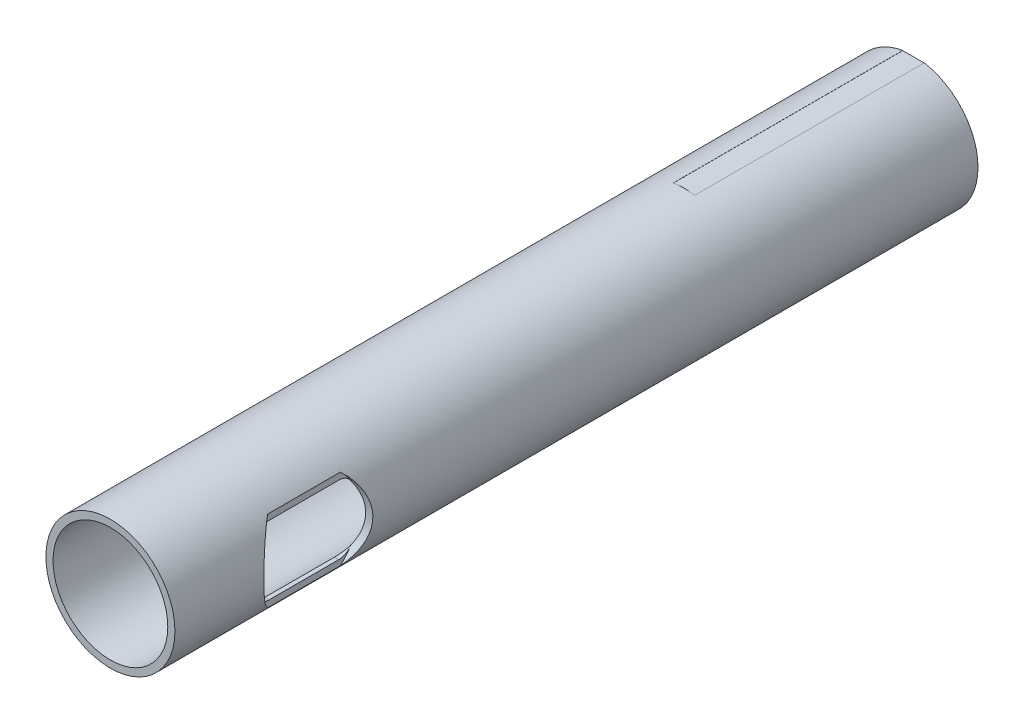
ISO-10303-21;
HEADER;
FILE_DESCRIPTION(('STEP AP214'),'2;1');
FILE_NAME('part.step','',(''),(''),'','','');
FILE_SCHEMA(('AUTOMOTIVE_DESIGN { 1 0 10303 214 1 1 1 1 }'));
ENDSEC;
DATA;
#1=APPLICATION_CONTEXT('core data for automotive mechanical design processes');
#2=APPLICATION_PROTOCOL_DEFINITION('international standard','automotive_design',2000,#1);
#3=PRODUCT_CONTEXT('',#1,'mechanical');
#4=PRODUCT('Part','Part','',(#3));
#5=PRODUCT_RELATED_PRODUCT_CATEGORY('part','',(#4));
#6=PRODUCT_DEFINITION_FORMATION('','',#4);
#7=PRODUCT_DEFINITION_CONTEXT('part definition',#1,'design');
#8=PRODUCT_DEFINITION('design','',#6,#7);
#9=PRODUCT_DEFINITION_SHAPE('','',#8);
#10=(LENGTH_UNIT() NAMED_UNIT(*) SI_UNIT(.MILLI.,.METRE.));
#11=(NAMED_UNIT(*) PLANE_ANGLE_UNIT() SI_UNIT($,.RADIAN.));
#12=(NAMED_UNIT(*) SI_UNIT($,.STERADIAN.) SOLID_ANGLE_UNIT());
#13=UNCERTAINTY_MEASURE_WITH_UNIT(LENGTH_MEASURE(1.E-05),#10,'distance_accuracy_value','');
#14=(GEOMETRIC_REPRESENTATION_CONTEXT(3) GLOBAL_UNCERTAINTY_ASSIGNED_CONTEXT((#13)) GLOBAL_UNIT_ASSIGNED_CONTEXT((#10,
#11,#12)) REPRESENTATION_CONTEXT('',''));
#15=CARTESIAN_POINT('',(0.,0.,0.));
#16=DIRECTION('',(0.,0.,1.));
#17=DIRECTION('',(1.,0.,0.));
#18=AXIS2_PLACEMENT_3D('',#15,#16,#17);
#19=CARTESIAN_POINT('',(0.,0.,-355.6));
#20=DIRECTION('',(0.,0.,1.));
#21=DIRECTION('',(1.,0.,0.));
#22=AXIS2_PLACEMENT_3D('',#19,#20,#21);
#23=CYLINDRICAL_SURFACE('',#22,28.575);
#24=DIRECTION('',(0.,0.,1.));
#25=VECTOR('',#24,1.);
#26=CARTESIAN_POINT('',(-4.74980000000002,28.1774737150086,-355.6));
#27=LINE('',#26,#25);
#28=CARTESIAN_POINT('',(-4.74980000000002,28.1774737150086,-355.6));
#29=VERTEX_POINT('',#28);
#30=CARTESIAN_POINT('',(-4.74980000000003,28.1774737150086,-254.));
#31=VERTEX_POINT('',#30);
#32=EDGE_CURVE('E347',#29,#31,#27,.T.);
#33=ORIENTED_EDGE('',*,*,#32,.F.);
#34=CARTESIAN_POINT('',(0.,0.,-355.6));
#35=DIRECTION('',(0.,0.,1.));
#36=DIRECTION('',(1.,0.,0.));
#37=AXIS2_PLACEMENT_3D('',#34,#35,#36);
#38=CIRCLE('',#37,28.575);
#39=CARTESIAN_POINT('',(-4.74980000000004,-28.1774737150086,-355.6));
#40=VERTEX_POINT('',#39);
#41=EDGE_CURVE('E207',#29,#40,#38,.T.);
#42=ORIENTED_EDGE('',*,*,#41,.T.);
#43=DIRECTION('',(0.,0.,1.));
#44=VECTOR('',#43,1.);
#45=CARTESIAN_POINT('',(-4.74980000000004,-28.1774737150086,-355.6));
#46=LINE('',#45,#44);
#47=CARTESIAN_POINT('',(-4.74980000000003,-28.1774737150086,-254.));
#48=VERTEX_POINT('',#47);
#49=EDGE_CURVE('E375',#48,#40,#46,.F.);
#50=ORIENTED_EDGE('',*,*,#49,.F.);
#51=CARTESIAN_POINT('',(0.,0.,-254.));
#52=DIRECTION('',(0.,0.,1.));
#53=DIRECTION('',(1.,0.,0.));
#54=AXIS2_PLACEMENT_3D('',#51,#52,#53);
#55=CIRCLE('',#54,28.575);
#56=CARTESIAN_POINT('',(4.74979999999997,-28.1774737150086,-254.));
#57=VERTEX_POINT('',#56);
#58=EDGE_CURVE('E217',#57,#48,#55,.F.);
#59=ORIENTED_EDGE('',*,*,#58,.F.);
#60=DIRECTION('',(0.,0.,1.));
#61=VECTOR('',#60,1.);
#62=CARTESIAN_POINT('',(4.74979999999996,-28.1774737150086,-355.6));
#63=LINE('',#62,#61);
#64=CARTESIAN_POINT('',(4.74979999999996,-28.1774737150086,-355.6));
#65=VERTEX_POINT('',#64);
#66=EDGE_CURVE('E369',#65,#57,#63,.T.);
#67=ORIENTED_EDGE('',*,*,#66,.F.);
#68=CARTESIAN_POINT('',(4.74979999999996,28.1774737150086,-355.6));
#69=VERTEX_POINT('',#68);
#70=EDGE_CURVE('E455',#65,#69,#38,.T.);
#71=ORIENTED_EDGE('',*,*,#70,.T.);
#72=DIRECTION('',(0.,0.,1.));
#73=VECTOR('',#72,1.);
#74=CARTESIAN_POINT('',(4.74979999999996,28.1774737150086,-355.6));
#75=LINE('',#74,#73);
#76=CARTESIAN_POINT('',(4.74979999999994,28.1774737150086,-254.));
#77=VERTEX_POINT('',#76);
#78=EDGE_CURVE('E342',#77,#69,#75,.F.);
#79=ORIENTED_EDGE('',*,*,#78,.F.);
#80=CARTESIAN_POINT('',(0.,0.,-254.));
#81=DIRECTION('',(0.,0.,1.));
#82=DIRECTION('',(1.,0.,0.));
#83=AXIS2_PLACEMENT_3D('',#80,#81,#82);
#84=CIRCLE('',#83,28.575);
#85=EDGE_CURVE('E209',#31,#77,#84,.F.);
#86=ORIENTED_EDGE('',*,*,#85,.F.);
#87=EDGE_LOOP('',(#33,#42,#50,#59,#67,#71,#79,#86));
#88=FACE_BOUND('',#87,.T.);
#89=CARTESIAN_POINT('',(0.,0.,0.));
#90=DIRECTION('',(0.,0.,1.));
#91=DIRECTION('',(1.,0.,0.));
#92=AXIS2_PLACEMENT_3D('',#89,#90,#91);
#93=CIRCLE('',#92,28.575);
#94=CARTESIAN_POINT('',(28.575,0.,0.));
#95=VERTEX_POINT('',#94);
#96=EDGE_CURVE('E456',#95,#95,#93,.T.);
#97=ORIENTED_EDGE('',*,*,#96,.F.);
#98=EDGE_LOOP('',(#97));
#99=FACE_BOUND('',#98,.T.);
#100=CARTESIAN_POINT('',(22.225,-17.9605122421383,-47.3855065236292));
#101=CARTESIAN_POINT('',(22.3970312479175,-17.7476348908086,-47.1482542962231));
#102=CARTESIAN_POINT('',(22.5680680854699,-17.5297298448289,-46.9148333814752));
#103=CARTESIAN_POINT('',(22.9074990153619,-17.0837833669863,-46.4558296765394));
#104=CARTESIAN_POINT('',(23.0758928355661,-16.8557409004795,-46.2302476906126));
#105=CARTESIAN_POINT('',(23.5764540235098,-16.1558242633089,-45.565092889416));
#106=CARTESIAN_POINT('',(23.9036080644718,-15.6686431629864,-45.137650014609));
#107=CARTESIAN_POINT('',(24.5413552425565,-14.6498009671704,-44.3147858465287));
#108=CARTESIAN_POINT('',(24.8517964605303,-14.11781775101,-43.9196453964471));
#109=CARTESIAN_POINT('',(25.4474190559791,-13.0135555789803,-43.169000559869));
#110=CARTESIAN_POINT('',(25.732613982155,-12.4412985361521,-42.8134748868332));
#111=CARTESIAN_POINT('',(26.221628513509,-11.3682341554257,-42.2085573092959));
#112=CARTESIAN_POINT('',(26.4307057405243,-10.8740010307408,-41.9517365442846));
#113=CARTESIAN_POINT('',(26.8250744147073,-9.86109916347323,-41.4697914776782));
#114=CARTESIAN_POINT('',(27.0103664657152,-9.34243104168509,-41.2446663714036));
#115=CARTESIAN_POINT('',(27.353427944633,-8.28426349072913,-40.8295365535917));
#116=CARTESIAN_POINT('',(27.5112759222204,-7.74482909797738,-40.6394315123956));
#117=CARTESIAN_POINT('',(27.7970553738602,-6.64652209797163,-40.296302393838));
#118=CARTESIAN_POINT('',(27.9249871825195,-6.08764970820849,-40.1432779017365));
#119=CARTESIAN_POINT('',(28.1491183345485,-4.949433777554,-39.875764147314));
#120=CARTESIAN_POINT('',(28.2450483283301,-4.36995977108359,-39.7616018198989));
#121=CARTESIAN_POINT('',(28.4014532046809,-3.19947640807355,-39.5757163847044));
#122=CARTESIAN_POINT('',(28.4619277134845,-2.60846692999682,-39.5039937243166));
#123=CARTESIAN_POINT('',(28.5459138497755,-1.41999435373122,-39.4044363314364));
#124=CARTESIAN_POINT('',(28.569416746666,-0.822529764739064,-39.3766119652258));
#125=CARTESIAN_POINT('',(28.5788158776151,0.373076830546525,-39.3654809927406));
#126=CARTESIAN_POINT('',(28.5647158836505,0.97121876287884,-39.3821699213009));
#127=CARTESIAN_POINT('',(28.5031634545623,2.09220282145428,-39.4551062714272));
#128=CARTESIAN_POINT('',(28.4598420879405,2.6156033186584,-39.5064544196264));
#129=CARTESIAN_POINT('',(28.3451206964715,3.65485942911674,-39.6426427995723));
#130=CARTESIAN_POINT('',(28.2737233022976,4.17071574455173,-39.727479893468));
#131=CARTESIAN_POINT('',(28.1042310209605,5.19137624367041,-39.9293174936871));
#132=CARTESIAN_POINT('',(28.0061467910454,5.6961847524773,-40.0463051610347));
#133=CARTESIAN_POINT('',(27.7850022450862,6.69212381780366,-40.310823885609));
#134=CARTESIAN_POINT('',(27.6619407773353,7.18325374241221,-40.4583563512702));
#135=CARTESIAN_POINT('',(27.3889754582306,8.16338534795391,-40.7867697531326));
#136=CARTESIAN_POINT('',(27.238400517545,8.65191821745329,-40.9684888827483));
#137=CARTESIAN_POINT('',(26.9153142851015,9.61000044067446,-41.3601564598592));
#138=CARTESIAN_POINT('',(26.7428024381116,10.0795493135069,-41.5701056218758));
#139=CARTESIAN_POINT('',(26.3780055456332,10.9989292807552,-42.016470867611));
#140=CARTESIAN_POINT('',(26.1856891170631,11.4487274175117,-42.252929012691));
#141=CARTESIAN_POINT('',(25.7839697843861,12.3268283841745,-42.7500407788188));
#142=CARTESIAN_POINT('',(25.5745648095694,12.7551285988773,-43.0106973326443));
#143=CARTESIAN_POINT('',(25.1224825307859,13.6254233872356,-43.577721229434));
#144=CARTESIAN_POINT('',(24.8784925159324,14.0654290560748,-43.886091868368));
#145=CARTESIAN_POINT('',(24.3762761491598,14.9188815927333,-44.5271573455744));
#146=CARTESIAN_POINT('',(24.1180469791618,15.3323231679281,-44.8598570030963));
#147=CARTESIAN_POINT('',(23.59171120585,16.1303766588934,-45.5460707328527));
#148=CARTESIAN_POINT('',(23.3236604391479,16.515122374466,-45.8994724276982));
#149=CARTESIAN_POINT('',(22.7795960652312,17.2578289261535,-46.6271267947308));
#150=CARTESIAN_POINT('',(22.5035872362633,17.6158053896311,-47.0013670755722));
#151=CARTESIAN_POINT('',(22.225,17.9605122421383,-47.3855065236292));
#152=B_SPLINE_CURVE_WITH_KNOTS('',3,(#100,#101,#102,#103,#104,#105,#106,#107,#108,#109,#110,
#111,#112,#113,#114,#115,#116,#117,#118,#119,#120,#121,#122,#123,#124,#125,#126,#127,#128,#129,
#130,#131,#132,#133,#134,#135,#136,#137,#138,#139,#140,#141,#142,#143,#144,#145,#146,#147,#148,
#149,#150,#151),.UNSPECIFIED.,.F.,.F.,(4,2,2,2,2,2,2,2,2,2,2,2,2,2,2,2,2,2,2,2,2,2,2,2,2,4),(0.,
1.08653033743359,2.17317182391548,4.34891799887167,6.54191965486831,8.73373718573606,
10.5168549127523,12.2999273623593,14.0778091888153,15.8556711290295,17.6481399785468,
19.4406277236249,21.2335386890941,23.0262698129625,24.6075001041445,26.1885822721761,
27.7690339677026,29.3495585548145,30.975610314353,32.6017032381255,34.2304137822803,
35.8593219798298,37.6282867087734,39.3976027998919,41.1580732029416,42.9175077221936),.UNSPECIFIED.);
#153=CARTESIAN_POINT('',(22.225,-17.9605122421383,-47.3855065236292));
#154=VERTEX_POINT('',#153);
#155=CARTESIAN_POINT('',(22.225,17.9605122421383,-47.3855065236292));
#156=VERTEX_POINT('',#155);
#157=EDGE_CURVE('E401',#154,#156,#152,.T.);
#158=ORIENTED_EDGE('',*,*,#157,.T.);
#159=DIRECTION('',(0.,0.,1.));
#160=VECTOR('',#159,1.);
#161=CARTESIAN_POINT('',(22.225,17.9605122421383,-355.6));
#162=LINE('',#161,#160);
#163=CARTESIAN_POINT('',(22.225,17.9605122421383,-79.6144934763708));
#164=VERTEX_POINT('',#163);
#165=EDGE_CURVE('E389',#156,#164,#162,.F.);
#166=ORIENTED_EDGE('',*,*,#165,.T.);
#167=CARTESIAN_POINT('',(22.225,17.9605122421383,-79.6144934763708));
#168=CARTESIAN_POINT('',(22.3970312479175,17.7476348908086,-79.8517457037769));
#169=CARTESIAN_POINT('',(22.5680680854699,17.5297298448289,-80.0851666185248));
#170=CARTESIAN_POINT('',(22.9074990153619,17.0837833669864,-80.5441703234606));
#171=CARTESIAN_POINT('',(23.0758928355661,16.8557409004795,-80.7697523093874));
#172=CARTESIAN_POINT('',(23.5764540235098,16.1558242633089,-81.434907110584));
#173=CARTESIAN_POINT('',(23.9036080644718,15.6686431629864,-81.862349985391));
#174=CARTESIAN_POINT('',(24.5413552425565,14.6498009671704,-82.6852141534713));
#175=CARTESIAN_POINT('',(24.8517964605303,14.11781775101,-83.0803546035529));
#176=CARTESIAN_POINT('',(25.4474190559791,13.0135555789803,-83.8309994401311));
#177=CARTESIAN_POINT('',(25.732613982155,12.4412985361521,-84.1865251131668));
#178=CARTESIAN_POINT('',(26.221628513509,11.3682341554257,-84.7914426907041));
#179=CARTESIAN_POINT('',(26.4307057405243,10.8740010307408,-85.0482634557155));
#180=CARTESIAN_POINT('',(26.8250744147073,9.86109916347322,-85.5302085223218));
#181=CARTESIAN_POINT('',(27.0103664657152,9.34243104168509,-85.7553336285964));
#182=CARTESIAN_POINT('',(27.353427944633,8.28426349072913,-86.1704634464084));
#183=CARTESIAN_POINT('',(27.5112759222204,7.74482909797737,-86.3605684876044));
#184=CARTESIAN_POINT('',(27.7970553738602,6.64652209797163,-86.703697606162));
#185=CARTESIAN_POINT('',(27.9249871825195,6.08764970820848,-86.8567220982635));
#186=CARTESIAN_POINT('',(28.1491183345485,4.949433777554,-87.124235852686));
#187=CARTESIAN_POINT('',(28.2450483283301,4.36995977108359,-87.2383981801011));
#188=CARTESIAN_POINT('',(28.4014532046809,3.19947640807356,-87.4242836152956));
#189=CARTESIAN_POINT('',(28.4619277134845,2.60846692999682,-87.4960062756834));
#190=CARTESIAN_POINT('',(28.5459138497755,1.41999435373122,-87.5955636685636));
#191=CARTESIAN_POINT('',(28.569416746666,0.822529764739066,-87.6233880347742));
#192=CARTESIAN_POINT('',(28.5788158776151,-0.373076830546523,-87.6345190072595));
#193=CARTESIAN_POINT('',(28.5647158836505,-0.971218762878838,-87.6178300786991));
#194=CARTESIAN_POINT('',(28.5031634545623,-2.09220282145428,-87.5448937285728));
#195=CARTESIAN_POINT('',(28.4598420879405,-2.6156033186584,-87.4935455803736));
#196=CARTESIAN_POINT('',(28.3451206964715,-3.65485942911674,-87.3573572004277));
#197=CARTESIAN_POINT('',(28.2737233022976,-4.17071574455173,-87.272520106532));
#198=CARTESIAN_POINT('',(28.1042310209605,-5.19137624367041,-87.0706825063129));
#199=CARTESIAN_POINT('',(28.0061467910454,-5.6961847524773,-86.9536948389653));
#200=CARTESIAN_POINT('',(27.7850022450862,-6.69212381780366,-86.689176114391));
#201=CARTESIAN_POINT('',(27.6619407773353,-7.18325374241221,-86.5416436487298));
#202=CARTESIAN_POINT('',(27.3889754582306,-8.16338534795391,-86.2132302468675));
#203=CARTESIAN_POINT('',(27.238400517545,-8.65191821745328,-86.0315111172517));
#204=CARTESIAN_POINT('',(26.9153142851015,-9.61000044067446,-85.6398435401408));
#205=CARTESIAN_POINT('',(26.7428024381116,-10.0795493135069,-85.4298943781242));
#206=CARTESIAN_POINT('',(26.3780055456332,-10.9989292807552,-84.983529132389));
#207=CARTESIAN_POINT('',(26.1856891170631,-11.4487274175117,-84.747070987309));
#208=CARTESIAN_POINT('',(25.7839697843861,-12.3268283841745,-84.2499592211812));
#209=CARTESIAN_POINT('',(25.5745648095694,-12.7551285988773,-83.9893026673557));
#210=CARTESIAN_POINT('',(25.1224825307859,-13.6254233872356,-83.422278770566));
#211=CARTESIAN_POINT('',(24.8784925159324,-14.0654290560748,-83.113908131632));
#212=CARTESIAN_POINT('',(24.3762761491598,-14.9188815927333,-82.4728426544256));
#213=CARTESIAN_POINT('',(24.1180469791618,-15.3323231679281,-82.1401429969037));
#214=CARTESIAN_POINT('',(23.59171120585,-16.1303766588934,-81.4539292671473));
#215=CARTESIAN_POINT('',(23.3236604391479,-16.515122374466,-81.1005275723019));
#216=CARTESIAN_POINT('',(22.7795960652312,-17.2578289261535,-80.3728732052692));
#217=CARTESIAN_POINT('',(22.5035872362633,-17.6158053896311,-79.9986329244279));
#218=CARTESIAN_POINT('',(22.225,-17.9605122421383,-79.6144934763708));
#219=B_SPLINE_CURVE_WITH_KNOTS('',3,(#167,#168,#169,#170,#171,#172,#173,#174,#175,#176,#177,
#178,#179,#180,#181,#182,#183,#184,#185,#186,#187,#188,#189,#190,#191,#192,#193,#194,#195,#196,
#197,#198,#199,#200,#201,#202,#203,#204,#205,#206,#207,#208,#209,#210,#211,#212,#213,#214,#215,
#216,#217,#218),.UNSPECIFIED.,.F.,.F.,(4,2,2,2,2,2,2,2,2,2,2,2,2,2,2,2,2,2,2,2,2,2,2,2,2,4),(0.,
1.08653033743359,2.17317182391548,4.34891799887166,6.54191965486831,8.73373718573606,
10.5168549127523,12.2999273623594,14.0778091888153,15.8556711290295,17.6481399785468,
19.4406277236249,21.2335386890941,23.0262698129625,24.6075001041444,26.1885822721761,
27.7690339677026,29.3495585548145,30.975610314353,32.6017032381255,34.2304137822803,
35.8593219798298,37.6282867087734,39.3976027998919,41.1580732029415,42.9175077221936),.UNSPECIFIED.);
#220=CARTESIAN_POINT('',(22.225,-17.9605122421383,-79.6144934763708));
#221=VERTEX_POINT('',#220);
#222=EDGE_CURVE('E393',#164,#221,#219,.T.);
#223=ORIENTED_EDGE('',*,*,#222,.T.);
#224=DIRECTION('',(0.,0.,1.));
#225=VECTOR('',#224,1.);
#226=CARTESIAN_POINT('',(22.225,-17.9605122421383,-355.6));
#227=LINE('',#226,#225);
#228=EDGE_CURVE('E383',#221,#154,#227,.T.);
#229=ORIENTED_EDGE('',*,*,#228,.T.);
#230=EDGE_LOOP('',(#158,#166,#223,#229));
#231=FACE_BOUND('',#230,.T.);
#232=ADVANCED_FACE('F52',(#88,#99,#231),#23,.T.);
#233=CARTESIAN_POINT('',(0.,0.,-355.6));
#234=DIRECTION('',(0.,0.,1.));
#235=DIRECTION('',(1.,0.,0.));
#236=AXIS2_PLACEMENT_3D('',#233,#234,#235);
#237=CYLINDRICAL_SURFACE('',#236,25.4);
#238=DIRECTION('',(0.,0.,1.));
#239=VECTOR('',#238,1.);
#240=CARTESIAN_POINT('',(22.225,12.2967221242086,-84.2616840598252));
#241=LINE('',#240,#239);
#242=CARTESIAN_POINT('',(22.225,12.2967221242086,-84.2616840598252));
#243=VERTEX_POINT('',#242);
#244=CARTESIAN_POINT('',(22.225,12.2967221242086,-84.2567323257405));
#245=VERTEX_POINT('',#244);
#246=EDGE_CURVE('E57',#243,#245,#241,.T.);
#247=ORIENTED_EDGE('',*,*,#246,.T.);
#248=CARTESIAN_POINT('',(22.225,12.2967221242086,-84.2567323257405));
#249=CARTESIAN_POINT('',(22.1267762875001,12.4742956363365,-84.1438234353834));
#250=CARTESIAN_POINT('',(22.0287593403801,12.6463824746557,-84.0220468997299));
#251=CARTESIAN_POINT('',(21.8347040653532,12.9785385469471,-83.7611691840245));
#252=CARTESIAN_POINT('',(21.7386686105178,13.1385911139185,-83.6220446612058));
#253=CARTESIAN_POINT('',(21.5496575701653,13.4463824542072,-83.3260011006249));
#254=CARTESIAN_POINT('',(21.4567129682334,13.5940113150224,-83.1689473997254));
#255=CARTESIAN_POINT('',(21.2768318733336,13.8738634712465,-82.8388025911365));
#256=CARTESIAN_POINT('',(21.1898911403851,14.0060976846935,-82.6657230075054));
#257=CARTESIAN_POINT('',(20.9914259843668,14.3025563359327,-82.2325904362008));
#258=CARTESIAN_POINT('',(20.8837206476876,14.4588430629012,-81.9651479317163));
#259=CARTESIAN_POINT('',(20.7396534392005,14.6640295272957,-81.5450580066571));
#260=CARTESIAN_POINT('',(20.6946346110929,14.7274320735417,-81.4022438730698));
#261=CARTESIAN_POINT('',(20.6111404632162,14.8440566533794,-81.1106941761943));
#262=CARTESIAN_POINT('',(20.5726620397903,14.8972835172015,-80.9619614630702));
#263=CARTESIAN_POINT('',(20.5031393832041,14.9928241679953,-80.6595118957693));
#264=CARTESIAN_POINT('',(20.4720874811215,15.0351492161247,-80.5058003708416));
#265=CARTESIAN_POINT('',(20.4181418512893,15.1083267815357,-80.1942773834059));
#266=CARTESIAN_POINT('',(20.3952468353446,15.1391811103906,-80.0364665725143));
#267=CARTESIAN_POINT('',(20.3580390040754,15.1891834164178,-79.7160649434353));
#268=CARTESIAN_POINT('',(20.3438300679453,15.2081897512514,-79.5534397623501));
#269=CARTESIAN_POINT('',(20.3247814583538,15.2336241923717,-79.2265312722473));
#270=CARTESIAN_POINT('',(20.3199496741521,15.2400417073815,-79.0622466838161));
#271=CARTESIAN_POINT('',(20.32,15.24,-78.8979316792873));
#272=B_SPLINE_CURVE_WITH_KNOTS('',3,(#248,#249,#250,#251,#252,#253,#254,#255,#256,#257,#258,
#259,#260,#261,#262,#263,#264,#265,#266,#267,#268,#269,#270,#271),.UNSPECIFIED.,.F.,.F.,(4,2,2,
2,2,2,2,2,2,2,2,4),(0.,0.696482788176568,1.39391305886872,2.09697705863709,2.79953936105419,
3.77905076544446,4.26644095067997,4.75359920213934,5.24025220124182,5.72682831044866,
6.21911514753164,6.71181598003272),.UNSPECIFIED.);
#273=CARTESIAN_POINT('',(20.32,15.24,-78.8979316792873));
#274=VERTEX_POINT('',#273);
#275=EDGE_CURVE('E288',#245,#274,#272,.T.);
#276=ORIENTED_EDGE('',*,*,#275,.T.);
#277=DIRECTION('',(0.,0.,1.));
#278=VECTOR('',#277,1.);
#279=CARTESIAN_POINT('',(20.32,15.24,-355.6));
#280=LINE('',#279,#278);
#281=CARTESIAN_POINT('',(20.32,15.24,-48.1020683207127));
#282=VERTEX_POINT('',#281);
#283=EDGE_CURVE('E201',#274,#282,#280,.T.);
#284=ORIENTED_EDGE('',*,*,#283,.T.);
#285=CARTESIAN_POINT('',(20.32,15.24,-48.1020683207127));
#286=CARTESIAN_POINT('',(20.3199638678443,15.2400301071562,-47.9515310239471));
#287=CARTESIAN_POINT('',(20.3240133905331,15.2346483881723,-47.8010120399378));
#288=CARTESIAN_POINT('',(20.3400191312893,15.2132819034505,-47.5011588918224));
#289=CARTESIAN_POINT('',(20.351974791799,15.1972978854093,-47.3518246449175));
#290=CARTESIAN_POINT('',(20.3834150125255,15.1550993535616,-47.0565312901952));
#291=CARTESIAN_POINT('',(20.4028449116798,15.128959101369,-46.910555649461));
#292=CARTESIAN_POINT('',(20.4487582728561,15.0668438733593,-46.6219080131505));
#293=CARTESIAN_POINT('',(20.475238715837,15.0308731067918,-46.4792346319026));
#294=CARTESIAN_POINT('',(20.5237547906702,14.9645079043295,-46.2496541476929));
#295=CARTESIAN_POINT('',(20.5438515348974,14.9369166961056,-46.1615088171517));
#296=CARTESIAN_POINT('',(20.5864765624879,14.8781149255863,-45.9870127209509));
#297=CARTESIAN_POINT('',(20.6090054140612,14.8469035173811,-45.9006623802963));
#298=CARTESIAN_POINT('',(20.6800645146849,14.7479331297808,-45.6442860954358));
#299=CARTESIAN_POINT('',(20.7320125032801,14.6749124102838,-45.4771907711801));
#300=CARTESIAN_POINT('',(20.8435973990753,14.5159879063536,-45.151880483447));
#301=CARTESIAN_POINT('',(20.903240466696,14.4300737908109,-44.9936727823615));
#302=CARTESIAN_POINT('',(21.0921633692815,14.1538099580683,-44.5322587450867));
#303=CARTESIAN_POINT('',(21.2310716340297,13.9454348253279,-44.2435200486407));
#304=CARTESIAN_POINT('',(21.5109334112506,13.5092840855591,-43.7331762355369));
#305=CARTESIAN_POINT('',(21.650584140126,13.2849287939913,-43.5078715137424));
#306=CARTESIAN_POINT('',(21.8641814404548,12.9281340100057,-43.1989626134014));
#307=CARTESIAN_POINT('',(21.935774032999,12.8063504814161,-43.1011670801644));
#308=CARTESIAN_POINT('',(22.0798610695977,12.5562965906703,-42.9150618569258));
#309=CARTESIAN_POINT('',(22.1523552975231,12.4280277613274,-42.8267499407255));
#310=CARTESIAN_POINT('',(22.225,12.2967221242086,-42.7432676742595));
#311=B_SPLINE_CURVE_WITH_KNOTS('',3,(#285,#286,#287,#288,#289,#290,#291,#292,#293,#294,#295,
#296,#297,#298,#299,#300,#301,#302,#303,#304,#305,#306,#307,#308,#309,#310),.UNSPECIFIED.,.F.,
.F.,(4,2,2,2,2,2,2,2,2,2,2,2,4),(0.,0.451433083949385,0.902834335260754,1.35099527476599,
1.79896461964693,2.08242440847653,2.36595056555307,2.93381555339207,3.50213800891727,
4.64292774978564,5.68131859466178,6.19642472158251,6.71140966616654),.UNSPECIFIED.);
#312=CARTESIAN_POINT('',(22.225,12.2967221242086,-42.7432676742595));
#313=VERTEX_POINT('',#312);
#314=EDGE_CURVE('E76',#282,#313,#311,.T.);
#315=ORIENTED_EDGE('',*,*,#314,.T.);
#316=DIRECTION('',(0.,0.,1.));
#317=VECTOR('',#316,1.);
#318=CARTESIAN_POINT('',(22.225,12.2967221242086,-42.7432676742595));
#319=LINE('',#318,#317);
#320=CARTESIAN_POINT('',(22.225,12.2967221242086,-42.7383159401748));
#321=VERTEX_POINT('',#320);
#322=EDGE_CURVE('E63',#321,#313,#319,.F.);
#323=ORIENTED_EDGE('',*,*,#322,.F.);
#324=CARTESIAN_POINT('',(20.32,-15.24,-44.7917317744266));
#325=CARTESIAN_POINT('',(20.4900023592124,-15.0133248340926,-44.6070855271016));
#326=CARTESIAN_POINT('',(20.657444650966,-14.7821705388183,-44.4256322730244));
#327=CARTESIAN_POINT('',(20.986721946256,-14.3108421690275,-44.0695081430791));
#328=CARTESIAN_POINT('',(21.1485571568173,-14.070668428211,-43.8948370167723));
#329=CARTESIAN_POINT('',(21.6263028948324,-13.3343998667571,-43.3801029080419));
#330=CARTESIAN_POINT('',(21.932986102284,-12.8245014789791,-43.0509107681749));
#331=CARTESIAN_POINT('',(22.4644690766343,-11.8639110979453,-42.4819692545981));
#332=CARTESIAN_POINT('',(22.6940730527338,-11.4190751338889,-42.2367842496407));
#333=CARTESIAN_POINT('',(23.1309700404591,-10.5059203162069,-41.7710981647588));
#334=CARTESIAN_POINT('',(23.3382595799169,-10.037597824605,-41.5506009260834));
#335=CARTESIAN_POINT('',(23.7275238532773,-9.07920185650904,-41.1371482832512));
#336=CARTESIAN_POINT('',(23.9095171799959,-8.5891447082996,-40.9441726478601));
#337=CARTESIAN_POINT('',(24.2455529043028,-7.58890292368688,-40.5882743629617));
#338=CARTESIAN_POINT('',(24.399596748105,-7.07871933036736,-40.4253501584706));
#339=CARTESIAN_POINT('',(24.6781515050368,-6.03671599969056,-40.1309960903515));
#340=CARTESIAN_POINT('',(24.802416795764,-5.5047560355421,-39.9998280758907));
#341=CARTESIAN_POINT('',(25.0173442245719,-4.42657881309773,-39.7731014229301));
#342=CARTESIAN_POINT('',(25.1080058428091,-3.88036133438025,-39.6775433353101));
#343=CARTESIAN_POINT('',(25.2537151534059,-2.77824650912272,-39.5240200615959));
#344=CARTESIAN_POINT('',(25.3087818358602,-2.2223544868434,-39.4660348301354));
#345=CARTESIAN_POINT('',(25.3820997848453,-1.10548573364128,-39.3888399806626));
#346=CARTESIAN_POINT('',(25.400354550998,-0.544509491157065,-39.3696266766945));
#347=CARTESIAN_POINT('',(25.3996677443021,0.526050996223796,-39.3703498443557));
#348=CARTESIAN_POINT('',(25.3839737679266,1.03564556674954,-39.3868681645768));
#349=CARTESIAN_POINT('',(25.322172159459,2.05090026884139,-39.4519354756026));
#350=CARTESIAN_POINT('',(25.2760663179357,2.55656063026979,-39.5004825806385));
#351=CARTESIAN_POINT('',(25.1542978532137,3.56049501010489,-39.6287619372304));
#352=CARTESIAN_POINT('',(25.0786229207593,4.05876586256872,-39.70850717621));
#353=CARTESIAN_POINT('',(24.8990940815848,5.04440958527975,-39.8978245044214));
#354=CARTESIAN_POINT('',(24.7952401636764,5.53178245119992,-40.0073966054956));
#355=CARTESIAN_POINT('',(24.5623816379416,6.48758516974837,-40.2533005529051));
#356=CARTESIAN_POINT('',(24.4336626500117,6.95616333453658,-40.3893286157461));
#357=CARTESIAN_POINT('',(24.1522929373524,7.87774780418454,-40.6870099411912));
#358=CARTESIAN_POINT('',(23.9996397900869,8.33075252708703,-40.8486657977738));
#359=CARTESIAN_POINT('',(23.6726460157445,9.21898155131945,-41.1954176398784));
#360=CARTESIAN_POINT('',(23.4983275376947,9.65422341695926,-41.3804896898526));
#361=CARTESIAN_POINT('',(23.1300052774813,10.5060984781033,-41.7721726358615));
#362=CARTESIAN_POINT('',(22.9360080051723,10.9227377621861,-41.9787764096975));
#363=CARTESIAN_POINT('',(22.6512704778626,11.4940728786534,-42.2826042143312));
#364=CARTESIAN_POINT('',(22.5678936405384,11.6569016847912,-42.3716363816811));
#365=CARTESIAN_POINT('',(22.3984488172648,11.9792580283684,-42.5527227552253));
#366=CARTESIAN_POINT('',(22.3123828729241,12.1387879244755,-42.6447746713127));
#367=CARTESIAN_POINT('',(21.9340692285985,12.8225450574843,-43.0497503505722));
#368=CARTESIAN_POINT('',(21.6285406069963,13.3306800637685,-43.3776938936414));
#369=CARTESIAN_POINT('',(20.9920634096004,14.3121149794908,-44.0634450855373));
#370=CARTESIAN_POINT('',(20.6610504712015,14.785320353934,-44.4213285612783));
#371=CARTESIAN_POINT('',(20.32,15.24,-44.7917317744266));
#372=B_SPLINE_CURVE_WITH_KNOTS('',3,(#324,#325,#326,#327,#328,#329,#330,#331,#332,#333,#334,
#335,#336,#337,#338,#339,#340,#341,#342,#343,#344,#345,#346,#347,#348,#349,#350,#351,#352,#353,
#354,#355,#356,#357,#358,#359,#360,#361,#362,#363,#364,#365,#366,#367,#368,#369,#370,#371),
.UNSPECIFIED.,.F.,.F.,(4,2,2,2,2,2,2,2,2,2,2,2,2,2,2,2,2,2,2,2,2,2,2,4),(0.,1.01446811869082,
2.02889874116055,4.0664660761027,5.73739465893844,7.40858286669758,9.07853617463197,
10.7484030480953,12.4316027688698,14.1148285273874,15.7971555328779,17.4793225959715,
19.0077221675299,20.536031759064,22.0649782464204,23.5939253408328,25.106254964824,
26.6187377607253,28.1296868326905,29.6401376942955,30.2504346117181,30.8602789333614,
32.8906822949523,34.9263933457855),.UNSPECIFIED.);
#373=CARTESIAN_POINT('',(22.225,-12.2967221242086,-42.7383159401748));
#374=VERTEX_POINT('',#373);
#375=EDGE_CURVE('E425',#374,#321,#372,.T.);
#376=ORIENTED_EDGE('',*,*,#375,.F.);
#377=DIRECTION('',(0.,0.,1.));
#378=VECTOR('',#377,1.);
#379=CARTESIAN_POINT('',(22.225,-12.2967221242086,-42.7383159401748));
#380=LINE('',#379,#378);
#381=CARTESIAN_POINT('',(22.225,-12.2967221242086,-42.7432676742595));
#382=VERTEX_POINT('',#381);
#383=EDGE_CURVE('E295',#374,#382,#380,.F.);
#384=ORIENTED_EDGE('',*,*,#383,.T.);
#385=CARTESIAN_POINT('',(22.225,-12.2967221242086,-42.7432676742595));
#386=CARTESIAN_POINT('',(22.1267762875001,-12.4742956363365,-42.8561765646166));
#387=CARTESIAN_POINT('',(22.0287593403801,-12.6463824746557,-42.9779531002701));
#388=CARTESIAN_POINT('',(21.8347040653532,-12.9785385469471,-43.2388308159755));
#389=CARTESIAN_POINT('',(21.7386686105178,-13.1385911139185,-43.3779553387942));
#390=CARTESIAN_POINT('',(21.5496575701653,-13.4463824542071,-43.6739988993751));
#391=CARTESIAN_POINT('',(21.4567129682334,-13.5940113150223,-43.8310526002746));
#392=CARTESIAN_POINT('',(21.2768318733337,-13.8738634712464,-44.1611974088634));
#393=CARTESIAN_POINT('',(21.1898911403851,-14.0060976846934,-44.3342769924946));
#394=CARTESIAN_POINT('',(20.9914259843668,-14.3025563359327,-44.7674095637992));
#395=CARTESIAN_POINT('',(20.8837206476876,-14.4588430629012,-45.0348520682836));
#396=CARTESIAN_POINT('',(20.7396534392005,-14.6640295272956,-45.4549419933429));
#397=CARTESIAN_POINT('',(20.6946346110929,-14.7274320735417,-45.5977561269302));
#398=CARTESIAN_POINT('',(20.6111404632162,-14.8440566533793,-45.8893058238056));
#399=CARTESIAN_POINT('',(20.5726620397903,-14.8972835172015,-46.0380385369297));
#400=CARTESIAN_POINT('',(20.5031393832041,-14.9928241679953,-46.3404881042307));
#401=CARTESIAN_POINT('',(20.4720874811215,-15.0351492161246,-46.4941996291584));
#402=CARTESIAN_POINT('',(20.4181418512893,-15.1083267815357,-46.8057226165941));
#403=CARTESIAN_POINT('',(20.3952468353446,-15.1391811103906,-46.9635334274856));
#404=CARTESIAN_POINT('',(20.3580390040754,-15.1891834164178,-47.2839350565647));
#405=CARTESIAN_POINT('',(20.3438300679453,-15.2081897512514,-47.4465602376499));
#406=CARTESIAN_POINT('',(20.3247814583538,-15.2336241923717,-47.7734687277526));
#407=CARTESIAN_POINT('',(20.3199496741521,-15.2400417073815,-47.9377533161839));
#408=CARTESIAN_POINT('',(20.32,-15.24,-48.1020683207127));
#409=B_SPLINE_CURVE_WITH_KNOTS('',3,(#385,#386,#387,#388,#389,#390,#391,#392,#393,#394,#395,
#396,#397,#398,#399,#400,#401,#402,#403,#404,#405,#406,#407,#408),.UNSPECIFIED.,.F.,.F.,(4,2,2,
2,2,2,2,2,2,2,2,4),(0.,0.696482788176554,1.39391305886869,2.09697705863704,2.79953936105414,
3.77905076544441,4.26644095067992,4.7535992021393,5.24025220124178,5.72682831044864,
6.21911514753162,6.71181598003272),.UNSPECIFIED.);
#410=CARTESIAN_POINT('',(20.32,-15.24,-48.1020683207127));
#411=VERTEX_POINT('',#410);
#412=EDGE_CURVE('E239',#382,#411,#409,.T.);
#413=ORIENTED_EDGE('',*,*,#412,.T.);
#414=DIRECTION('',(0.,0.,1.));
#415=VECTOR('',#414,1.);
#416=CARTESIAN_POINT('',(20.32,-15.24,-355.6));
#417=LINE('',#416,#415);
#418=CARTESIAN_POINT('',(20.32,-15.24,-78.8979316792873));
#419=VERTEX_POINT('',#418);
#420=EDGE_CURVE('E322',#411,#419,#417,.F.);
#421=ORIENTED_EDGE('',*,*,#420,.T.);
#422=CARTESIAN_POINT('',(20.32,-15.24,-78.8979316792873));
#423=CARTESIAN_POINT('',(20.3199638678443,-15.2400301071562,-79.0484689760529));
#424=CARTESIAN_POINT('',(20.3240133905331,-15.2346483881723,-79.1989879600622));
#425=CARTESIAN_POINT('',(20.3400191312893,-15.2132819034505,-79.4988411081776));
#426=CARTESIAN_POINT('',(20.351974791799,-15.1972978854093,-79.6481753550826));
#427=CARTESIAN_POINT('',(20.3834150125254,-15.1550993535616,-79.9434687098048));
#428=CARTESIAN_POINT('',(20.4028449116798,-15.128959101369,-80.089444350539));
#429=CARTESIAN_POINT('',(20.4487582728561,-15.0668438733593,-80.3780919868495));
#430=CARTESIAN_POINT('',(20.475238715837,-15.0308731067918,-80.5207653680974));
#431=CARTESIAN_POINT('',(20.5237547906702,-14.9645079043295,-80.7503458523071));
#432=CARTESIAN_POINT('',(20.5438515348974,-14.9369166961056,-80.8384911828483));
#433=CARTESIAN_POINT('',(20.5864765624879,-14.8781149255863,-81.0129872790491));
#434=CARTESIAN_POINT('',(20.6090054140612,-14.8469035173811,-81.0993376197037));
#435=CARTESIAN_POINT('',(20.6800645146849,-14.7479331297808,-81.3557139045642));
#436=CARTESIAN_POINT('',(20.7320125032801,-14.6749124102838,-81.5228092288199));
#437=CARTESIAN_POINT('',(20.8435973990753,-14.5159879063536,-81.848119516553));
#438=CARTESIAN_POINT('',(20.903240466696,-14.4300737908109,-82.0063272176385));
#439=CARTESIAN_POINT('',(21.0921633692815,-14.1538099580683,-82.4677412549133));
#440=CARTESIAN_POINT('',(21.2310716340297,-13.9454348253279,-82.7564799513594));
#441=CARTESIAN_POINT('',(21.5109334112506,-13.5092840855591,-83.2668237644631));
#442=CARTESIAN_POINT('',(21.650584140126,-13.2849287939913,-83.4921284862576));
#443=CARTESIAN_POINT('',(21.8641814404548,-12.9281340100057,-83.8010373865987));
#444=CARTESIAN_POINT('',(21.935774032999,-12.8063504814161,-83.8988329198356));
#445=CARTESIAN_POINT('',(22.0798610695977,-12.5562965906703,-84.0849381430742));
#446=CARTESIAN_POINT('',(22.152355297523,-12.4280277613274,-84.1732500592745));
#447=CARTESIAN_POINT('',(22.225,-12.2967221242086,-84.2567323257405));
#448=B_SPLINE_CURVE_WITH_KNOTS('',3,(#422,#423,#424,#425,#426,#427,#428,#429,#430,#431,#432,
#433,#434,#435,#436,#437,#438,#439,#440,#441,#442,#443,#444,#445,#446,#447),.UNSPECIFIED.,.F.,
.F.,(4,2,2,2,2,2,2,2,2,2,2,2,4),(0.,0.451433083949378,0.902834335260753,1.35099527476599,
1.79896461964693,2.08242440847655,2.36595056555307,2.93381555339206,3.50213800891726,
4.64292774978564,5.68131859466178,6.1964247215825,6.71140966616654),.UNSPECIFIED.);
#449=CARTESIAN_POINT('',(22.225,-12.2967221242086,-84.2567323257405));
#450=VERTEX_POINT('',#449);
#451=EDGE_CURVE('E70',#419,#450,#448,.T.);
#452=ORIENTED_EDGE('',*,*,#451,.T.);
#453=DIRECTION('',(0.,0.,1.));
#454=VECTOR('',#453,1.);
#455=CARTESIAN_POINT('',(22.225,-12.2967221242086,-84.2567323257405));
#456=LINE('',#455,#454);
#457=CARTESIAN_POINT('',(22.225,-12.2967221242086,-84.2616840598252));
#458=VERTEX_POINT('',#457);
#459=EDGE_CURVE('E13',#458,#450,#456,.T.);
#460=ORIENTED_EDGE('',*,*,#459,.F.);
#461=CARTESIAN_POINT('',(20.32,15.24,-82.2082682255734));
#462=CARTESIAN_POINT('',(20.4900023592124,15.0133248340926,-82.3929144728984));
#463=CARTESIAN_POINT('',(20.657444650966,14.7821705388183,-82.5743677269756));
#464=CARTESIAN_POINT('',(20.986721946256,14.3108421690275,-82.9304918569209));
#465=CARTESIAN_POINT('',(21.1485571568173,14.070668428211,-83.1051629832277));
#466=CARTESIAN_POINT('',(21.6263028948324,13.3343998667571,-83.6198970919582));
#467=CARTESIAN_POINT('',(21.932986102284,12.8245014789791,-83.9490892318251));
#468=CARTESIAN_POINT('',(22.4644690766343,11.8639110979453,-84.5180307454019));
#469=CARTESIAN_POINT('',(22.6940730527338,11.4190751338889,-84.7632157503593));
#470=CARTESIAN_POINT('',(23.1309700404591,10.5059203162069,-85.2289018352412));
#471=CARTESIAN_POINT('',(23.3382595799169,10.037597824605,-85.4493990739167));
#472=CARTESIAN_POINT('',(23.7275238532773,9.07920185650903,-85.8628517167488));
#473=CARTESIAN_POINT('',(23.9095171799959,8.5891447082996,-86.05582735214));
#474=CARTESIAN_POINT('',(24.2455529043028,7.58890292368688,-86.4117256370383));
#475=CARTESIAN_POINT('',(24.399596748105,7.07871933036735,-86.5746498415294));
#476=CARTESIAN_POINT('',(24.6781515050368,6.03671599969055,-86.8690039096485));
#477=CARTESIAN_POINT('',(24.802416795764,5.5047560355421,-87.0001719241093));
#478=CARTESIAN_POINT('',(25.0173442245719,4.42657881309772,-87.2268985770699));
#479=CARTESIAN_POINT('',(25.1080058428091,3.88036133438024,-87.3224566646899));
#480=CARTESIAN_POINT('',(25.2537151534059,2.77824650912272,-87.4759799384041));
#481=CARTESIAN_POINT('',(25.3087818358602,2.2223544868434,-87.5339651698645));
#482=CARTESIAN_POINT('',(25.3820997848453,1.10548573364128,-87.6111600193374));
#483=CARTESIAN_POINT('',(25.400354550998,0.54450949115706,-87.6303733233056));
#484=CARTESIAN_POINT('',(25.3996677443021,-0.526050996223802,-87.6296501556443));
#485=CARTESIAN_POINT('',(25.3839737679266,-1.03564556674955,-87.6131318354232));
#486=CARTESIAN_POINT('',(25.322172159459,-2.0509002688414,-87.5480645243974));
#487=CARTESIAN_POINT('',(25.2760663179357,-2.55656063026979,-87.4995174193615));
#488=CARTESIAN_POINT('',(25.1542978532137,-3.56049501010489,-87.3712380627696));
#489=CARTESIAN_POINT('',(25.0786229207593,-4.05876586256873,-87.29149282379));
#490=CARTESIAN_POINT('',(24.8990940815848,-5.04440958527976,-87.1021754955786));
#491=CARTESIAN_POINT('',(24.7952401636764,-5.53178245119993,-86.9926033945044));
#492=CARTESIAN_POINT('',(24.5623816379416,-6.48758516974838,-86.7466994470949));
#493=CARTESIAN_POINT('',(24.4336626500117,-6.95616333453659,-86.6106713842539));
#494=CARTESIAN_POINT('',(24.1522929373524,-7.87774780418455,-86.3129900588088));
#495=CARTESIAN_POINT('',(23.9996397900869,-8.33075252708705,-86.1513342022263));
#496=CARTESIAN_POINT('',(23.6726460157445,-9.21898155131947,-85.8045823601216));
#497=CARTESIAN_POINT('',(23.4983275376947,-9.65422341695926,-85.6195103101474));
#498=CARTESIAN_POINT('',(23.1300052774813,-10.5060984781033,-85.2278273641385));
#499=CARTESIAN_POINT('',(22.9360080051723,-10.9227377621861,-85.0212235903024));
#500=CARTESIAN_POINT('',(22.6512704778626,-11.4940728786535,-84.7173957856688));
#501=CARTESIAN_POINT('',(22.5678936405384,-11.6569016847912,-84.6283636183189));
#502=CARTESIAN_POINT('',(22.3984488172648,-11.9792580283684,-84.4472772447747));
#503=CARTESIAN_POINT('',(22.3123828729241,-12.1387879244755,-84.3552253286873));
#504=CARTESIAN_POINT('',(21.9340692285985,-12.8225450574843,-83.9502496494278));
#505=CARTESIAN_POINT('',(21.6285406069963,-13.3306800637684,-83.6223061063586));
#506=CARTESIAN_POINT('',(20.9920634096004,-14.3121149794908,-82.9365549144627));
#507=CARTESIAN_POINT('',(20.6610504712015,-14.7853203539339,-82.5786714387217));
#508=CARTESIAN_POINT('',(20.32,-15.24,-82.2082682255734));
#509=B_SPLINE_CURVE_WITH_KNOTS('',3,(#461,#462,#463,#464,#465,#466,#467,#468,#469,#470,#471,
#472,#473,#474,#475,#476,#477,#478,#479,#480,#481,#482,#483,#484,#485,#486,#487,#488,#489,#490,
#491,#492,#493,#494,#495,#496,#497,#498,#499,#500,#501,#502,#503,#504,#505,#506,#507,#508),
.UNSPECIFIED.,.F.,.F.,(4,2,2,2,2,2,2,2,2,2,2,2,2,2,2,2,2,2,2,2,2,2,2,4),(0.,1.01446811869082,
2.02889874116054,4.0664660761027,5.73739465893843,7.40858286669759,9.07853617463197,
10.7484030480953,12.4316027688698,14.1148285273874,15.7971555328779,17.4793225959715,
19.0077221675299,20.536031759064,22.0649782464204,23.5939253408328,25.106254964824,
26.6187377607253,28.1296868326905,29.6401376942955,30.2504346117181,30.8602789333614,
32.8906822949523,34.9263933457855),.UNSPECIFIED.);
#510=EDGE_CURVE('E312',#243,#458,#509,.T.);
#511=ORIENTED_EDGE('',*,*,#510,.F.);
#512=EDGE_LOOP('',(#247,#276,#284,#315,#323,#376,#384,#413,#421,#452,#460,#511));
#513=FACE_BOUND('',#512,.T.);
#514=CARTESIAN_POINT('',(0.,0.,0.));
#515=DIRECTION('',(0.,0.,1.));
#516=DIRECTION('',(1.,0.,0.));
#517=AXIS2_PLACEMENT_3D('',#514,#515,#516);
#518=CIRCLE('',#517,25.4);
#519=CARTESIAN_POINT('',(25.4,0.,0.));
#520=VERTEX_POINT('',#519);
#521=EDGE_CURVE('E465',#520,#520,#518,.T.);
#522=ORIENTED_EDGE('',*,*,#521,.T.);
#523=EDGE_LOOP('',(#522));
#524=FACE_BOUND('',#523,.T.);
#525=CARTESIAN_POINT('',(0.,0.,-355.6));
#526=DIRECTION('',(0.,0.,1.));
#527=DIRECTION('',(1.,0.,0.));
#528=AXIS2_PLACEMENT_3D('',#525,#526,#527);
#529=CIRCLE('',#528,25.4);
#530=CARTESIAN_POINT('',(25.4,0.,-355.6));
#531=VERTEX_POINT('',#530);
#532=EDGE_CURVE('E463',#531,#531,#529,.T.);
#533=ORIENTED_EDGE('',*,*,#532,.F.);
#534=EDGE_LOOP('',(#533));
#535=FACE_BOUND('',#534,.T.);
#536=ADVANCED_FACE('F254',(#513,#524,#535),#237,.F.);
#537=CARTESIAN_POINT('',(0.,0.,-355.6));
#538=DIRECTION('',(0.,0.,1.));
#539=DIRECTION('',(1.,0.,0.));
#540=AXIS2_PLACEMENT_3D('',#537,#538,#539);
#541=PLANE('',#540);
#542=ORIENTED_EDGE('',*,*,#41,.F.);
#543=DIRECTION('',(0.,-1.,0.));
#544=VECTOR('',#543,1.);
#545=CARTESIAN_POINT('',(-4.74980000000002,0.,-355.6));
#546=LINE('',#545,#544);
#547=CARTESIAN_POINT('',(-4.74980000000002,28.1178,-355.6));
#548=VERTEX_POINT('',#547);
#549=EDGE_CURVE('E196',#29,#548,#546,.T.);
#550=ORIENTED_EDGE('',*,*,#549,.T.);
#551=DIRECTION('',(1.,0.,0.));
#552=VECTOR('',#551,1.);
#553=CARTESIAN_POINT('',(-4.74980000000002,28.1178,-355.6));
#554=LINE('',#553,#552);
#555=CARTESIAN_POINT('',(4.74979999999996,28.1178,-355.6));
#556=VERTEX_POINT('',#555);
#557=EDGE_CURVE('E180',#548,#556,#554,.T.);
#558=ORIENTED_EDGE('',*,*,#557,.T.);
#559=DIRECTION('',(0.,1.,0.));
#560=VECTOR('',#559,1.);
#561=CARTESIAN_POINT('',(4.74979999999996,0.,-355.6));
#562=LINE('',#561,#560);
#563=EDGE_CURVE('E210',#556,#69,#562,.T.);
#564=ORIENTED_EDGE('',*,*,#563,.T.);
#565=ORIENTED_EDGE('',*,*,#70,.F.);
#566=DIRECTION('',(0.,1.,0.));
#567=VECTOR('',#566,1.);
#568=CARTESIAN_POINT('',(4.74979999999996,0.,-355.6));
#569=LINE('',#568,#567);
#570=CARTESIAN_POINT('',(4.74979999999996,-28.067,-355.6));
#571=VERTEX_POINT('',#570);
#572=EDGE_CURVE('E433',#65,#571,#569,.T.);
#573=ORIENTED_EDGE('',*,*,#572,.T.);
#574=DIRECTION('',(-1.,0.,0.));
#575=VECTOR('',#574,1.);
#576=CARTESIAN_POINT('',(-4.74980000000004,-28.067,-355.6));
#577=LINE('',#576,#575);
#578=CARTESIAN_POINT('',(-4.74980000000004,-28.067,-355.6));
#579=VERTEX_POINT('',#578);
#580=EDGE_CURVE('E361',#571,#579,#577,.T.);
#581=ORIENTED_EDGE('',*,*,#580,.T.);
#582=DIRECTION('',(0.,-1.,0.));
#583=VECTOR('',#582,1.);
#584=CARTESIAN_POINT('',(-4.74980000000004,0.,-355.6));
#585=LINE('',#584,#583);
#586=EDGE_CURVE('E437',#579,#40,#585,.T.);
#587=ORIENTED_EDGE('',*,*,#586,.T.);
#588=EDGE_LOOP('',(#542,#550,#558,#564,#565,#573,#581,#587));
#589=FACE_BOUND('',#588,.T.);
#590=ORIENTED_EDGE('',*,*,#532,.T.);
#591=EDGE_LOOP('',(#590));
#592=FACE_BOUND('',#591,.T.);
#593=ADVANCED_FACE('F204',(#589,#592),#541,.F.);
#594=CARTESIAN_POINT('',(0.,0.,0.));
#595=DIRECTION('',(0.,0.,1.));
#596=DIRECTION('',(1.,0.,0.));
#597=AXIS2_PLACEMENT_3D('',#594,#595,#596);
#598=PLANE('',#597);
#599=ORIENTED_EDGE('',*,*,#521,.F.);
#600=EDGE_LOOP('',(#599));
#601=FACE_BOUND('',#600,.T.);
#602=ORIENTED_EDGE('',*,*,#96,.T.);
#603=EDGE_LOOP('',(#602));
#604=FACE_BOUND('',#603,.T.);
#605=ADVANCED_FACE('F412',(#601,#604),#598,.T.);
#606=CARTESIAN_POINT('',(47.625,0.,-63.5));
#607=DIRECTION('',(-1.,0.,0.));
#608=DIRECTION('',(0.,0.,1.));
#609=AXIS2_PLACEMENT_3D('',#606,#607,#608);
#610=CYLINDRICAL_SURFACE('',#609,24.13);
#611=CARTESIAN_POINT('',(22.225,0.,-63.5));
#612=DIRECTION('',(1.,0.,0.));
#613=DIRECTION('',(0.,0.,-1.));
#614=AXIS2_PLACEMENT_3D('',#611,#612,#613);
#615=CIRCLE('',#614,24.13);
#616=EDGE_CURVE('E385',#374,#154,#615,.T.);
#617=ORIENTED_EDGE('',*,*,#616,.F.);
#618=ORIENTED_EDGE('',*,*,#375,.T.);
#619=EDGE_CURVE('E384',#156,#321,#615,.T.);
#620=ORIENTED_EDGE('',*,*,#619,.F.);
#621=ORIENTED_EDGE('',*,*,#157,.F.);
#622=EDGE_LOOP('',(#617,#618,#620,#621));
#623=FACE_BOUND('',#622,.T.);
#624=ADVANCED_FACE('F407',(#623),#610,.F.);
#625=ORIENTED_EDGE('',*,*,#510,.T.);
#626=EDGE_CURVE('E379',#221,#458,#615,.T.);
#627=ORIENTED_EDGE('',*,*,#626,.F.);
#628=ORIENTED_EDGE('',*,*,#222,.F.);
#629=EDGE_CURVE('E380',#243,#164,#615,.T.);
#630=ORIENTED_EDGE('',*,*,#629,.F.);
#631=EDGE_LOOP('',(#625,#627,#628,#630));
#632=FACE_BOUND('',#631,.T.);
#633=ADVANCED_FACE('F411',(#632),#610,.F.);
#634=CARTESIAN_POINT('',(22.225,0.,-63.5));
#635=DIRECTION('',(1.,0.,0.));
#636=DIRECTION('',(0.,0.,-1.));
#637=AXIS2_PLACEMENT_3D('',#634,#635,#636);
#638=PLANE('',#637);
#639=DIRECTION('',(0.,0.,1.));
#640=VECTOR('',#639,1.);
#641=CARTESIAN_POINT('',(22.225,15.24,-44.7917317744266));
#642=LINE('',#641,#640);
#643=CARTESIAN_POINT('',(22.225,15.24,-78.8979316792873));
#644=VERTEX_POINT('',#643);
#645=CARTESIAN_POINT('',(22.225,15.24,-48.1020683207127));
#646=VERTEX_POINT('',#645);
#647=EDGE_CURVE('E318',#644,#646,#642,.T.);
#648=ORIENTED_EDGE('',*,*,#647,.F.);
#649=CARTESIAN_POINT('',(22.225,8.89,-78.8979316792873));
#650=DIRECTION('',(1.,0.,0.));
#651=DIRECTION('',(0.,0.,-1.));
#652=AXIS2_PLACEMENT_3D('',#649,#650,#651);
#653=CIRCLE('',#652,6.35);
#654=EDGE_CURVE('E285',#644,#245,#653,.F.);
#655=ORIENTED_EDGE('',*,*,#654,.T.);
#656=ORIENTED_EDGE('',*,*,#246,.F.);
#657=ORIENTED_EDGE('',*,*,#629,.T.);
#658=ORIENTED_EDGE('',*,*,#165,.F.);
#659=ORIENTED_EDGE('',*,*,#619,.T.);
#660=ORIENTED_EDGE('',*,*,#322,.T.);
#661=CARTESIAN_POINT('',(22.225,8.89,-48.1020683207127));
#662=DIRECTION('',(1.,0.,0.));
#663=DIRECTION('',(0.,0.,-1.));
#664=AXIS2_PLACEMENT_3D('',#661,#662,#663);
#665=CIRCLE('',#664,6.35);
#666=EDGE_CURVE('E282',#313,#646,#665,.F.);
#667=ORIENTED_EDGE('',*,*,#666,.T.);
#668=EDGE_LOOP('',(#648,#655,#656,#657,#658,#659,#660,#667));
#669=FACE_BOUND('',#668,.T.);
#670=ADVANCED_FACE('F320',(#669),#638,.T.);
#671=DIRECTION('',(0.,0.,-1.));
#672=VECTOR('',#671,1.);
#673=CARTESIAN_POINT('',(22.225,-15.24,-44.7917317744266));
#674=LINE('',#673,#672);
#675=CARTESIAN_POINT('',(22.225,-15.24,-48.1020683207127));
#676=VERTEX_POINT('',#675);
#677=CARTESIAN_POINT('',(22.225,-15.24,-78.8979316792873));
#678=VERTEX_POINT('',#677);
#679=EDGE_CURVE('E323',#676,#678,#674,.T.);
#680=ORIENTED_EDGE('',*,*,#679,.F.);
#681=CARTESIAN_POINT('',(22.225,-8.89,-48.1020683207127));
#682=DIRECTION('',(1.,0.,0.));
#683=DIRECTION('',(0.,0.,-1.));
#684=AXIS2_PLACEMENT_3D('',#681,#682,#683);
#685=CIRCLE('',#684,6.35);
#686=EDGE_CURVE('E236',#676,#382,#685,.F.);
#687=ORIENTED_EDGE('',*,*,#686,.T.);
#688=ORIENTED_EDGE('',*,*,#383,.F.);
#689=ORIENTED_EDGE('',*,*,#616,.T.);
#690=ORIENTED_EDGE('',*,*,#228,.F.);
#691=ORIENTED_EDGE('',*,*,#626,.T.);
#692=ORIENTED_EDGE('',*,*,#459,.T.);
#693=CARTESIAN_POINT('',(22.225,-8.89,-78.8979316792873));
#694=DIRECTION('',(1.,0.,0.));
#695=DIRECTION('',(0.,0.,-1.));
#696=AXIS2_PLACEMENT_3D('',#693,#694,#695);
#697=CIRCLE('',#696,6.35);
#698=EDGE_CURVE('E281',#450,#678,#697,.F.);
#699=ORIENTED_EDGE('',*,*,#698,.T.);
#700=EDGE_LOOP('',(#680,#687,#688,#689,#690,#691,#692,#699));
#701=FACE_BOUND('',#700,.T.);
#702=ADVANCED_FACE('F515',(#701),#638,.T.);
#703=CARTESIAN_POINT('',(-4.74980000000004,-28.575,-355.6));
#704=DIRECTION('',(-1.,0.,0.));
#705=DIRECTION('',(0.,0.,1.));
#706=AXIS2_PLACEMENT_3D('',#703,#704,#705);
#707=PLANE('',#706);
#708=ORIENTED_EDGE('',*,*,#49,.T.);
#709=ORIENTED_EDGE('',*,*,#586,.F.);
#710=DIRECTION('',(0.,0.,1.));
#711=VECTOR('',#710,1.);
#712=CARTESIAN_POINT('',(-4.74980000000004,-28.067,-355.6));
#713=LINE('',#712,#711);
#714=CARTESIAN_POINT('',(-4.74980000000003,-28.067,-254.));
#715=VERTEX_POINT('',#714);
#716=EDGE_CURVE('E350',#579,#715,#713,.T.);
#717=ORIENTED_EDGE('',*,*,#716,.T.);
#718=DIRECTION('',(0.,1.,0.));
#719=VECTOR('',#718,1.);
#720=CARTESIAN_POINT('',(-4.74980000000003,-28.575,-254.));
#721=LINE('',#720,#719);
#722=EDGE_CURVE('E365',#48,#715,#721,.T.);
#723=ORIENTED_EDGE('',*,*,#722,.F.);
#724=EDGE_LOOP('',(#708,#709,#717,#723));
#725=FACE_BOUND('',#724,.T.);
#726=ADVANCED_FACE('F450',(#725),#707,.F.);
#727=CARTESIAN_POINT('',(4.74979999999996,-28.575,-355.6));
#728=DIRECTION('',(1.,0.,0.));
#729=DIRECTION('',(0.,0.,-1.));
#730=AXIS2_PLACEMENT_3D('',#727,#728,#729);
#731=PLANE('',#730);
#732=ORIENTED_EDGE('',*,*,#66,.T.);
#733=DIRECTION('',(0.,1.,0.));
#734=VECTOR('',#733,1.);
#735=CARTESIAN_POINT('',(4.74979999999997,-28.575,-254.));
#736=LINE('',#735,#734);
#737=CARTESIAN_POINT('',(4.74979999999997,-28.067,-254.));
#738=VERTEX_POINT('',#737);
#739=EDGE_CURVE('E366',#57,#738,#736,.T.);
#740=ORIENTED_EDGE('',*,*,#739,.T.);
#741=DIRECTION('',(0.,0.,-1.));
#742=VECTOR('',#741,1.);
#743=CARTESIAN_POINT('',(4.74979999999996,-28.067,-355.6));
#744=LINE('',#743,#742);
#745=EDGE_CURVE('E358',#738,#571,#744,.T.);
#746=ORIENTED_EDGE('',*,*,#745,.T.);
#747=ORIENTED_EDGE('',*,*,#572,.F.);
#748=EDGE_LOOP('',(#732,#740,#746,#747));
#749=FACE_BOUND('',#748,.T.);
#750=ADVANCED_FACE('F535',(#749),#731,.F.);
#751=CARTESIAN_POINT('',(-4.74980000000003,-28.575,-254.));
#752=DIRECTION('',(0.,0.,1.));
#753=DIRECTION('',(1.,0.,0.));
#754=AXIS2_PLACEMENT_3D('',#751,#752,#753);
#755=PLANE('',#754);
#756=ORIENTED_EDGE('',*,*,#739,.F.);
#757=ORIENTED_EDGE('',*,*,#58,.T.);
#758=ORIENTED_EDGE('',*,*,#722,.T.);
#759=DIRECTION('',(1.,0.,0.));
#760=VECTOR('',#759,1.);
#761=CARTESIAN_POINT('',(-4.74980000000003,-28.067,-254.));
#762=LINE('',#761,#760);
#763=EDGE_CURVE('E354',#715,#738,#762,.T.);
#764=ORIENTED_EDGE('',*,*,#763,.T.);
#765=EDGE_LOOP('',(#756,#757,#758,#764));
#766=FACE_BOUND('',#765,.T.);
#767=ADVANCED_FACE('F444',(#766),#755,.F.);
#768=CARTESIAN_POINT('',(0.,-28.067,0.));
#769=DIRECTION('',(0.,1.,0.));
#770=DIRECTION('',(0.,0.,1.));
#771=AXIS2_PLACEMENT_3D('',#768,#769,#770);
#772=PLANE('',#771);
#773=ORIENTED_EDGE('',*,*,#716,.F.);
#774=ORIENTED_EDGE('',*,*,#580,.F.);
#775=ORIENTED_EDGE('',*,*,#745,.F.);
#776=ORIENTED_EDGE('',*,*,#763,.F.);
#777=EDGE_LOOP('',(#773,#774,#775,#776));
#778=FACE_BOUND('',#777,.T.);
#779=ADVANCED_FACE('F551',(#778),#772,.F.);
#780=CARTESIAN_POINT('',(-4.74980000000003,30.6578,-254.));
#781=DIRECTION('',(-1.,0.,0.));
#782=DIRECTION('',(0.,0.,1.));
#783=AXIS2_PLACEMENT_3D('',#780,#781,#782);
#784=PLANE('',#783);
#785=ORIENTED_EDGE('',*,*,#32,.T.);
#786=DIRECTION('',(0.,-1.,0.));
#787=VECTOR('',#786,1.);
#788=CARTESIAN_POINT('',(-4.74980000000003,30.6578,-254.));
#789=LINE('',#788,#787);
#790=CARTESIAN_POINT('',(-4.74980000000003,28.1178,-254.));
#791=VERTEX_POINT('',#790);
#792=EDGE_CURVE('E199',#31,#791,#789,.T.);
#793=ORIENTED_EDGE('',*,*,#792,.T.);
#794=DIRECTION('',(0.,0.,-1.));
#795=VECTOR('',#794,1.);
#796=CARTESIAN_POINT('',(-4.74980000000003,28.1178,-254.));
#797=LINE('',#796,#795);
#798=EDGE_CURVE('E184',#791,#548,#797,.T.);
#799=ORIENTED_EDGE('',*,*,#798,.T.);
#800=ORIENTED_EDGE('',*,*,#549,.F.);
#801=EDGE_LOOP('',(#785,#793,#799,#800));
#802=FACE_BOUND('',#801,.T.);
#803=ADVANCED_FACE('F195',(#802),#784,.F.);
#804=CARTESIAN_POINT('',(-4.74980000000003,30.6578,-254.));
#805=DIRECTION('',(0.,0.,1.));
#806=DIRECTION('',(1.,0.,0.));
#807=AXIS2_PLACEMENT_3D('',#804,#805,#806);
#808=PLANE('',#807);
#809=ORIENTED_EDGE('',*,*,#85,.T.);
#810=DIRECTION('',(0.,-1.,0.));
#811=VECTOR('',#810,1.);
#812=CARTESIAN_POINT('',(4.74979999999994,30.6578,-254.));
#813=LINE('',#812,#811);
#814=CARTESIAN_POINT('',(4.74979999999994,28.1178,-254.));
#815=VERTEX_POINT('',#814);
#816=EDGE_CURVE('E339',#77,#815,#813,.T.);
#817=ORIENTED_EDGE('',*,*,#816,.T.);
#818=DIRECTION('',(-1.,0.,0.));
#819=VECTOR('',#818,1.);
#820=CARTESIAN_POINT('',(-4.74980000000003,28.1178,-254.));
#821=LINE('',#820,#819);
#822=EDGE_CURVE('E336',#815,#791,#821,.T.);
#823=ORIENTED_EDGE('',*,*,#822,.T.);
#824=ORIENTED_EDGE('',*,*,#792,.F.);
#825=EDGE_LOOP('',(#809,#817,#823,#824));
#826=FACE_BOUND('',#825,.T.);
#827=ADVANCED_FACE('F567',(#826),#808,.F.);
#828=CARTESIAN_POINT('',(4.74979999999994,30.6578,-254.));
#829=DIRECTION('',(1.,0.,0.));
#830=DIRECTION('',(0.,0.,-1.));
#831=AXIS2_PLACEMENT_3D('',#828,#829,#830);
#832=PLANE('',#831);
#833=ORIENTED_EDGE('',*,*,#78,.T.);
#834=ORIENTED_EDGE('',*,*,#563,.F.);
#835=DIRECTION('',(0.,0.,1.));
#836=VECTOR('',#835,1.);
#837=CARTESIAN_POINT('',(4.74979999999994,28.1178,-254.));
#838=LINE('',#837,#836);
#839=EDGE_CURVE('E187',#556,#815,#838,.T.);
#840=ORIENTED_EDGE('',*,*,#839,.T.);
#841=ORIENTED_EDGE('',*,*,#816,.F.);
#842=EDGE_LOOP('',(#833,#834,#840,#841));
#843=FACE_BOUND('',#842,.T.);
#844=ADVANCED_FACE('F576',(#843),#832,.F.);
#845=CARTESIAN_POINT('',(0.,28.1178,0.));
#846=DIRECTION('',(0.,-1.,0.));
#847=DIRECTION('',(0.,0.,-1.));
#848=AXIS2_PLACEMENT_3D('',#845,#846,#847);
#849=PLANE('',#848);
#850=ORIENTED_EDGE('',*,*,#798,.F.);
#851=ORIENTED_EDGE('',*,*,#822,.F.);
#852=ORIENTED_EDGE('',*,*,#839,.F.);
#853=ORIENTED_EDGE('',*,*,#557,.F.);
#854=EDGE_LOOP('',(#850,#851,#852,#853));
#855=FACE_BOUND('',#854,.T.);
#856=ADVANCED_FACE('F182',(#855),#849,.F.);
#857=CARTESIAN_POINT('',(19.685,-15.24,-44.7917317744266));
#858=DIRECTION('',(0.,-1.,0.));
#859=DIRECTION('',(0.,0.,-1.));
#860=AXIS2_PLACEMENT_3D('',#857,#858,#859);
#861=PLANE('',#860);
#862=ORIENTED_EDGE('',*,*,#420,.F.);
#863=DIRECTION('',(-1.,0.,0.));
#864=VECTOR('',#863,1.);
#865=CARTESIAN_POINT('',(19.685,-15.24,-48.1020683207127));
#866=LINE('',#865,#864);
#867=EDGE_CURVE('E224',#411,#676,#866,.F.);
#868=ORIENTED_EDGE('',*,*,#867,.T.);
#869=ORIENTED_EDGE('',*,*,#679,.T.);
#870=DIRECTION('',(-1.,0.,0.));
#871=VECTOR('',#870,1.);
#872=CARTESIAN_POINT('',(19.685,-15.24,-78.8979316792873));
#873=LINE('',#872,#871);
#874=EDGE_CURVE('E215',#678,#419,#873,.T.);
#875=ORIENTED_EDGE('',*,*,#874,.T.);
#876=EDGE_LOOP('',(#862,#868,#869,#875));
#877=FACE_BOUND('',#876,.T.);
#878=ADVANCED_FACE('F594',(#877),#861,.F.);
#879=CARTESIAN_POINT('',(19.685,15.24,-44.7917317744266));
#880=DIRECTION('',(0.,1.,0.));
#881=DIRECTION('',(0.,0.,1.));
#882=AXIS2_PLACEMENT_3D('',#879,#880,#881);
#883=PLANE('',#882);
#884=ORIENTED_EDGE('',*,*,#647,.T.);
#885=DIRECTION('',(-1.,0.,0.));
#886=VECTOR('',#885,1.);
#887=CARTESIAN_POINT('',(19.685,15.24,-48.1020683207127));
#888=LINE('',#887,#886);
#889=EDGE_CURVE('E232',#646,#282,#888,.T.);
#890=ORIENTED_EDGE('',*,*,#889,.T.);
#891=ORIENTED_EDGE('',*,*,#283,.F.);
#892=DIRECTION('',(-1.,0.,0.));
#893=VECTOR('',#892,1.);
#894=CARTESIAN_POINT('',(19.685,15.24,-78.8979316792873));
#895=LINE('',#894,#893);
#896=EDGE_CURVE('E228',#274,#644,#895,.F.);
#897=ORIENTED_EDGE('',*,*,#896,.T.);
#898=EDGE_LOOP('',(#884,#890,#891,#897));
#899=FACE_BOUND('',#898,.T.);
#900=ADVANCED_FACE('F263',(#899),#883,.F.);
#901=CARTESIAN_POINT('',(47.625,-8.89,-48.1020683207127));
#902=DIRECTION('',(-1.,0.,0.));
#903=DIRECTION('',(0.,0.,1.));
#904=AXIS2_PLACEMENT_3D('',#901,#902,#903);
#905=CYLINDRICAL_SURFACE('',#904,6.35);
#906=ORIENTED_EDGE('',*,*,#867,.F.);
#907=ORIENTED_EDGE('',*,*,#412,.F.);
#908=ORIENTED_EDGE('',*,*,#686,.F.);
#909=EDGE_LOOP('',(#906,#907,#908));
#910=FACE_BOUND('',#909,.T.);
#911=ADVANCED_FACE('F258',(#910),#905,.F.);
#912=CARTESIAN_POINT('',(47.625,8.89,-48.1020683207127));
#913=DIRECTION('',(-1.,0.,0.));
#914=DIRECTION('',(0.,0.,1.));
#915=AXIS2_PLACEMENT_3D('',#912,#913,#914);
#916=CYLINDRICAL_SURFACE('',#915,6.35);
#917=ORIENTED_EDGE('',*,*,#314,.F.);
#918=ORIENTED_EDGE('',*,*,#889,.F.);
#919=ORIENTED_EDGE('',*,*,#666,.F.);
#920=EDGE_LOOP('',(#917,#918,#919));
#921=FACE_BOUND('',#920,.T.);
#922=ADVANCED_FACE('F262',(#921),#916,.F.);
#923=CARTESIAN_POINT('',(47.625,-8.89,-78.8979316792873));
#924=DIRECTION('',(-1.,0.,0.));
#925=DIRECTION('',(0.,0.,1.));
#926=AXIS2_PLACEMENT_3D('',#923,#924,#925);
#927=CYLINDRICAL_SURFACE('',#926,6.35);
#928=ORIENTED_EDGE('',*,*,#451,.F.);
#929=ORIENTED_EDGE('',*,*,#874,.F.);
#930=ORIENTED_EDGE('',*,*,#698,.F.);
#931=EDGE_LOOP('',(#928,#929,#930));
#932=FACE_BOUND('',#931,.T.);
#933=ADVANCED_FACE('F269',(#932),#927,.F.);
#934=CARTESIAN_POINT('',(47.625,8.89,-78.8979316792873));
#935=DIRECTION('',(-1.,0.,0.));
#936=DIRECTION('',(0.,0.,1.));
#937=AXIS2_PLACEMENT_3D('',#934,#935,#936);
#938=CYLINDRICAL_SURFACE('',#937,6.35);
#939=ORIENTED_EDGE('',*,*,#896,.F.);
#940=ORIENTED_EDGE('',*,*,#275,.F.);
#941=ORIENTED_EDGE('',*,*,#654,.F.);
#942=EDGE_LOOP('',(#939,#940,#941));
#943=FACE_BOUND('',#942,.T.);
#944=ADVANCED_FACE('F54',(#943),#938,.F.);
#945=CLOSED_SHELL('',(#232,#536,#593,#605,#624,#633,#670,#702,#726,#750,#767,#779,#803,#827,
#844,#856,#878,#900,#911,#922,#933,#944));
#946=MANIFOLD_SOLID_BREP('B2',#945);
#947=ADVANCED_BREP_SHAPE_REPRESENTATION('',(#18,#946),#14);
#948=SHAPE_DEFINITION_REPRESENTATION(#9,#947);
ENDSEC;
END-ISO-10303-21;
